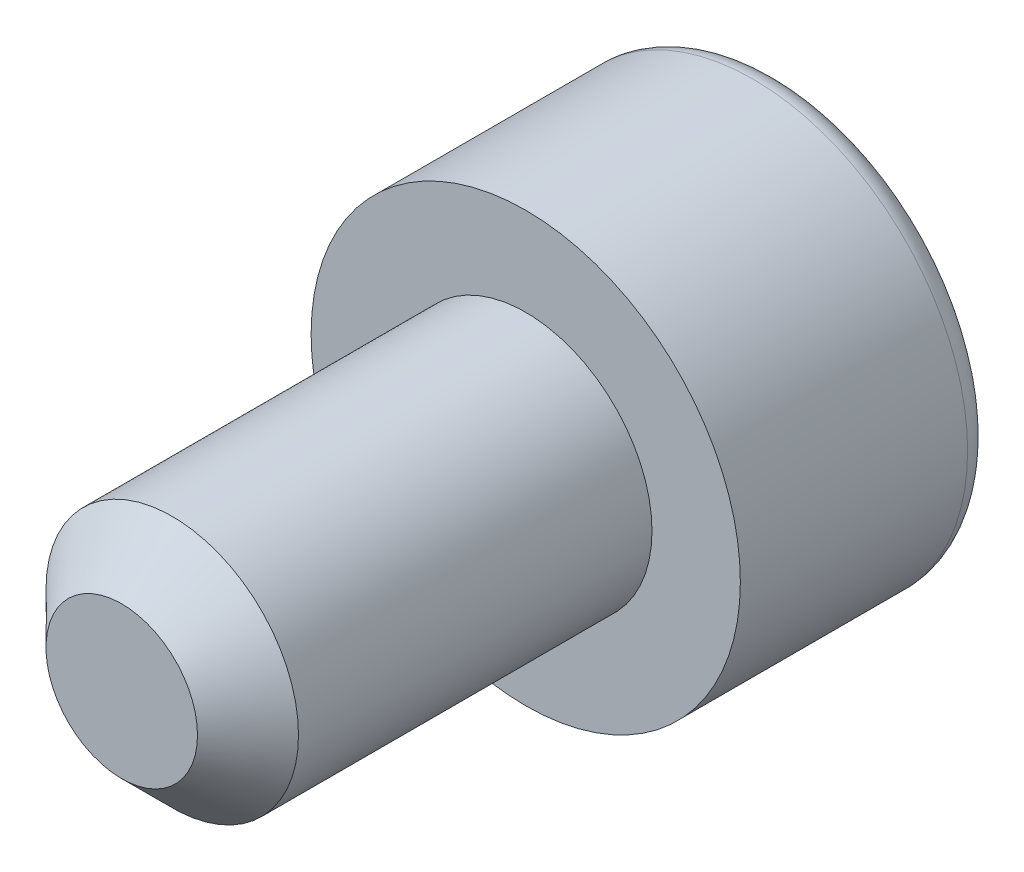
ISO-10303-21;
HEADER;
FILE_DESCRIPTION(('STEP AP214'),'2;1');
FILE_NAME('part.step','',(''),(''),'','','');
FILE_SCHEMA(('AUTOMOTIVE_DESIGN { 1 0 10303 214 1 1 1 1 }'));
ENDSEC;
DATA;
#1=APPLICATION_CONTEXT('core data for automotive mechanical design processes');
#2=APPLICATION_PROTOCOL_DEFINITION('international standard','automotive_design',2000,#1);
#3=PRODUCT_CONTEXT('',#1,'mechanical');
#4=PRODUCT('Part','Part','',(#3));
#5=PRODUCT_RELATED_PRODUCT_CATEGORY('part','',(#4));
#6=PRODUCT_DEFINITION_FORMATION('','',#4);
#7=PRODUCT_DEFINITION_CONTEXT('part definition',#1,'design');
#8=PRODUCT_DEFINITION('design','',#6,#7);
#9=PRODUCT_DEFINITION_SHAPE('','',#8);
#10=(LENGTH_UNIT() NAMED_UNIT(*) SI_UNIT(.MILLI.,.METRE.));
#11=(NAMED_UNIT(*) PLANE_ANGLE_UNIT() SI_UNIT($,.RADIAN.));
#12=(NAMED_UNIT(*) SI_UNIT($,.STERADIAN.) SOLID_ANGLE_UNIT());
#13=UNCERTAINTY_MEASURE_WITH_UNIT(LENGTH_MEASURE(1.E-05),#10,'distance_accuracy_value','');
#14=(GEOMETRIC_REPRESENTATION_CONTEXT(3) GLOBAL_UNCERTAINTY_ASSIGNED_CONTEXT((#13)) GLOBAL_UNIT_ASSIGNED_CONTEXT((#10,
#11,#12)) REPRESENTATION_CONTEXT('',''));
#15=CARTESIAN_POINT('',(0.,0.,0.));
#16=DIRECTION('',(0.,0.,1.));
#17=DIRECTION('',(1.,0.,0.));
#18=AXIS2_PLACEMENT_3D('',#15,#16,#17);
#19=CARTESIAN_POINT('',(0.,0.,-5.));
#20=DIRECTION('',(0.,0.,1.));
#21=DIRECTION('',(1.,0.,0.));
#22=AXIS2_PLACEMENT_3D('',#19,#20,#21);
#23=PLANE('',#22);
#24=CARTESIAN_POINT('',(0.,0.,-5.));
#25=DIRECTION('',(0.,0.,-1.));
#26=DIRECTION('',(-1.,0.,0.));
#27=AXIS2_PLACEMENT_3D('',#24,#25,#26);
#28=CIRCLE('',#27,3.75);
#29=CARTESIAN_POINT('',(-3.75,0.,-5.));
#30=VERTEX_POINT('',#29);
#31=EDGE_CURVE('E460',#30,#30,#28,.T.);
#32=ORIENTED_EDGE('',*,*,#31,.T.);
#33=EDGE_LOOP('',(#32));
#34=FACE_BOUND('',#33,.T.);
#35=DIRECTION('',(-0.86602540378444,0.499999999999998,0.));
#36=VECTOR('',#35,1.);
#37=CARTESIAN_POINT('',(0.,2.3094010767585,-5.));
#38=LINE('',#37,#36);
#39=CARTESIAN_POINT('',(2.,1.15470053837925,-5.));
#40=VERTEX_POINT('',#39);
#41=CARTESIAN_POINT('',(0.,2.3094010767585,-5.));
#42=VERTEX_POINT('',#41);
#43=EDGE_CURVE('E364',#40,#42,#38,.T.);
#44=ORIENTED_EDGE('',*,*,#43,.T.);
#45=DIRECTION('',(-0.866025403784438,-0.500000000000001,0.));
#46=VECTOR('',#45,1.);
#47=CARTESIAN_POINT('',(0.,2.3094010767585,-5.));
#48=LINE('',#47,#46);
#49=CARTESIAN_POINT('',(-2.,1.15470053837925,-5.));
#50=VERTEX_POINT('',#49);
#51=EDGE_CURVE('E404',#42,#50,#48,.T.);
#52=ORIENTED_EDGE('',*,*,#51,.T.);
#53=DIRECTION('',(0.,-1.,0.));
#54=VECTOR('',#53,1.);
#55=CARTESIAN_POINT('',(-2.,-1.15470053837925,-5.));
#56=LINE('',#55,#54);
#57=CARTESIAN_POINT('',(-2.,-1.15470053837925,-5.));
#58=VERTEX_POINT('',#57);
#59=EDGE_CURVE('E412',#50,#58,#56,.T.);
#60=ORIENTED_EDGE('',*,*,#59,.T.);
#61=DIRECTION('',(0.866025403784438,-0.500000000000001,0.));
#62=VECTOR('',#61,1.);
#63=CARTESIAN_POINT('',(0.,-2.3094010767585,-5.));
#64=LINE('',#63,#62);
#65=CARTESIAN_POINT('',(0.,-2.3094010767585,-5.));
#66=VERTEX_POINT('',#65);
#67=EDGE_CURVE('E430',#58,#66,#64,.T.);
#68=ORIENTED_EDGE('',*,*,#67,.T.);
#69=DIRECTION('',(0.86602540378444,0.499999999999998,0.));
#70=VECTOR('',#69,1.);
#71=CARTESIAN_POINT('',(0.,-2.3094010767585,-5.));
#72=LINE('',#71,#70);
#73=CARTESIAN_POINT('',(2.,-1.15470053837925,-5.));
#74=VERTEX_POINT('',#73);
#75=EDGE_CURVE('E433',#66,#74,#72,.T.);
#76=ORIENTED_EDGE('',*,*,#75,.T.);
#77=DIRECTION('',(0.,1.,0.));
#78=VECTOR('',#77,1.);
#79=CARTESIAN_POINT('',(2.,-1.15470053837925,-5.));
#80=LINE('',#79,#78);
#81=EDGE_CURVE('E423',#74,#40,#80,.T.);
#82=ORIENTED_EDGE('',*,*,#81,.T.);
#83=EDGE_LOOP('',(#44,#52,#60,#68,#76,#82));
#84=FACE_BOUND('',#83,.T.);
#85=ADVANCED_FACE('F350',(#34,#84),#23,.F.);
#86=CARTESIAN_POINT('',(0.,0.,-4.5));
#87=DIRECTION('',(0.,0.,-1.));
#88=DIRECTION('',(-1.,0.,0.));
#89=AXIS2_PLACEMENT_3D('',#86,#87,#88);
#90=TOROIDAL_SURFACE('',#89,3.75,0.5);
#91=ORIENTED_EDGE('',*,*,#31,.F.);
#92=EDGE_LOOP('',(#91));
#93=FACE_BOUND('',#92,.T.);
#94=CARTESIAN_POINT('',(0.,0.,-4.5));
#95=DIRECTION('',(0.,0.,-1.));
#96=DIRECTION('',(-1.,0.,0.));
#97=AXIS2_PLACEMENT_3D('',#94,#95,#96);
#98=CIRCLE('',#97,4.25);
#99=CARTESIAN_POINT('',(-4.25,0.,-4.5));
#100=VERTEX_POINT('',#99);
#101=EDGE_CURVE('E457',#100,#100,#98,.T.);
#102=ORIENTED_EDGE('',*,*,#101,.T.);
#103=EDGE_LOOP('',(#102));
#104=FACE_BOUND('',#103,.T.);
#105=ADVANCED_FACE('F479',(#93,#104),#90,.T.);
#106=CARTESIAN_POINT('',(0.,0.,0.));
#107=DIRECTION('',(0.,0.,-1.));
#108=DIRECTION('',(-1.,0.,0.));
#109=AXIS2_PLACEMENT_3D('',#106,#107,#108);
#110=CYLINDRICAL_SURFACE('',#109,4.25);
#111=ORIENTED_EDGE('',*,*,#101,.F.);
#112=EDGE_LOOP('',(#111));
#113=FACE_BOUND('',#112,.T.);
#114=CARTESIAN_POINT('',(0.,0.,0.));
#115=DIRECTION('',(0.,0.,-1.));
#116=DIRECTION('',(-1.,0.,0.));
#117=AXIS2_PLACEMENT_3D('',#114,#115,#116);
#118=CIRCLE('',#117,4.25);
#119=CARTESIAN_POINT('',(-4.25,0.,0.));
#120=VERTEX_POINT('',#119);
#121=EDGE_CURVE('E418',#120,#120,#118,.T.);
#122=ORIENTED_EDGE('',*,*,#121,.T.);
#123=EDGE_LOOP('',(#122));
#124=FACE_BOUND('',#123,.T.);
#125=ADVANCED_FACE('F484',(#113,#124),#110,.T.);
#126=CARTESIAN_POINT('',(0.,0.,0.));
#127=DIRECTION('',(0.,0.,-1.));
#128=DIRECTION('',(-1.,0.,0.));
#129=AXIS2_PLACEMENT_3D('',#126,#127,#128);
#130=PLANE('',#129);
#131=CARTESIAN_POINT('',(0.,0.,0.));
#132=DIRECTION('',(0.,0.,1.));
#133=DIRECTION('',(1.,0.,0.));
#134=AXIS2_PLACEMENT_3D('',#131,#132,#133);
#135=CIRCLE('',#134,2.5);
#136=CARTESIAN_POINT('',(2.5,0.,0.));
#137=VERTEX_POINT('',#136);
#138=EDGE_CURVE('E424',#137,#137,#135,.T.);
#139=ORIENTED_EDGE('',*,*,#138,.F.);
#140=EDGE_LOOP('',(#139));
#141=FACE_BOUND('',#140,.T.);
#142=ORIENTED_EDGE('',*,*,#121,.F.);
#143=EDGE_LOOP('',(#142));
#144=FACE_BOUND('',#143,.T.);
#145=ADVANCED_FACE('F492',(#141,#144),#130,.F.);
#146=CARTESIAN_POINT('',(0.,2.3094010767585,-2.5));
#147=DIRECTION('',(-0.499999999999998,-0.86602540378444,0.));
#148=DIRECTION('',(0.86602540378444,-0.499999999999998,0.));
#149=AXIS2_PLACEMENT_3D('',#146,#147,#148);
#150=PLANE('',#149);
#151=ORIENTED_EDGE('',*,*,#43,.F.);
#152=DIRECTION('',(0.,0.,-1.));
#153=VECTOR('',#152,1.);
#154=CARTESIAN_POINT('',(2.,1.15470053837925,-2.5));
#155=LINE('',#154,#153);
#156=CARTESIAN_POINT('',(2.,1.15470053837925,-2.5));
#157=VERTEX_POINT('',#156);
#158=EDGE_CURVE('E446',#157,#40,#155,.T.);
#159=ORIENTED_EDGE('',*,*,#158,.F.);
#160=DIRECTION('',(-0.86602540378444,0.499999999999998,0.));
#161=VECTOR('',#160,1.);
#162=CARTESIAN_POINT('',(0.,2.3094010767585,-2.5));
#163=LINE('',#162,#161);
#164=CARTESIAN_POINT('',(0.,2.3094010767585,-2.5));
#165=VERTEX_POINT('',#164);
#166=EDGE_CURVE('E417',#157,#165,#163,.T.);
#167=ORIENTED_EDGE('',*,*,#166,.T.);
#168=DIRECTION('',(0.,0.,-1.));
#169=VECTOR('',#168,1.);
#170=CARTESIAN_POINT('',(0.,2.3094010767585,-2.5));
#171=LINE('',#170,#169);
#172=EDGE_CURVE('E406',#165,#42,#171,.T.);
#173=ORIENTED_EDGE('',*,*,#172,.T.);
#174=EDGE_LOOP('',(#151,#159,#167,#173));
#175=FACE_BOUND('',#174,.T.);
#176=ADVANCED_FACE('F415',(#175),#150,.T.);
#177=CARTESIAN_POINT('',(0.,2.3094010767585,-2.5));
#178=DIRECTION('',(0.500000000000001,-0.866025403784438,0.));
#179=DIRECTION('',(0.866025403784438,0.500000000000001,0.));
#180=AXIS2_PLACEMENT_3D('',#177,#178,#179);
#181=PLANE('',#180);
#182=ORIENTED_EDGE('',*,*,#51,.F.);
#183=ORIENTED_EDGE('',*,*,#172,.F.);
#184=DIRECTION('',(-0.866025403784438,-0.500000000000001,0.));
#185=VECTOR('',#184,1.);
#186=CARTESIAN_POINT('',(0.,2.3094010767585,-2.5));
#187=LINE('',#186,#185);
#188=CARTESIAN_POINT('',(-2.,1.15470053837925,-2.5));
#189=VERTEX_POINT('',#188);
#190=EDGE_CURVE('E437',#165,#189,#187,.T.);
#191=ORIENTED_EDGE('',*,*,#190,.T.);
#192=DIRECTION('',(0.,0.,-1.));
#193=VECTOR('',#192,1.);
#194=CARTESIAN_POINT('',(-2.,1.15470053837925,-2.5));
#195=LINE('',#194,#193);
#196=EDGE_CURVE('E408',#189,#50,#195,.T.);
#197=ORIENTED_EDGE('',*,*,#196,.T.);
#198=EDGE_LOOP('',(#182,#183,#191,#197));
#199=FACE_BOUND('',#198,.T.);
#200=ADVANCED_FACE('F405',(#199),#181,.T.);
#201=CARTESIAN_POINT('',(-2.,-1.15470053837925,-2.5));
#202=DIRECTION('',(1.,0.,0.));
#203=DIRECTION('',(0.,0.,-1.));
#204=AXIS2_PLACEMENT_3D('',#201,#202,#203);
#205=PLANE('',#204);
#206=ORIENTED_EDGE('',*,*,#59,.F.);
#207=ORIENTED_EDGE('',*,*,#196,.F.);
#208=DIRECTION('',(0.,-1.,0.));
#209=VECTOR('',#208,1.);
#210=CARTESIAN_POINT('',(-2.,-1.15470053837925,-2.5));
#211=LINE('',#210,#209);
#212=CARTESIAN_POINT('',(-2.,-1.15470053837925,-2.5));
#213=VERTEX_POINT('',#212);
#214=EDGE_CURVE('E439',#189,#213,#211,.T.);
#215=ORIENTED_EDGE('',*,*,#214,.T.);
#216=DIRECTION('',(0.,0.,-1.));
#217=VECTOR('',#216,1.);
#218=CARTESIAN_POINT('',(-2.,-1.15470053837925,-2.5));
#219=LINE('',#218,#217);
#220=EDGE_CURVE('E452',#213,#58,#219,.T.);
#221=ORIENTED_EDGE('',*,*,#220,.T.);
#222=EDGE_LOOP('',(#206,#207,#215,#221));
#223=FACE_BOUND('',#222,.T.);
#224=ADVANCED_FACE('F507',(#223),#205,.T.);
#225=CARTESIAN_POINT('',(0.,-2.3094010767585,-2.5));
#226=DIRECTION('',(0.500000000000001,0.866025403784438,0.));
#227=DIRECTION('',(-0.866025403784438,0.500000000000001,0.));
#228=AXIS2_PLACEMENT_3D('',#225,#226,#227);
#229=PLANE('',#228);
#230=ORIENTED_EDGE('',*,*,#67,.F.);
#231=ORIENTED_EDGE('',*,*,#220,.F.);
#232=DIRECTION('',(0.866025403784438,-0.500000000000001,0.));
#233=VECTOR('',#232,1.);
#234=CARTESIAN_POINT('',(0.,-2.3094010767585,-2.5));
#235=LINE('',#234,#233);
#236=CARTESIAN_POINT('',(0.,-2.3094010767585,-2.5));
#237=VERTEX_POINT('',#236);
#238=EDGE_CURVE('E441',#213,#237,#235,.T.);
#239=ORIENTED_EDGE('',*,*,#238,.T.);
#240=DIRECTION('',(0.,0.,-1.));
#241=VECTOR('',#240,1.);
#242=CARTESIAN_POINT('',(0.,-2.3094010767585,-2.5));
#243=LINE('',#242,#241);
#244=EDGE_CURVE('E450',#237,#66,#243,.T.);
#245=ORIENTED_EDGE('',*,*,#244,.T.);
#246=EDGE_LOOP('',(#230,#231,#239,#245));
#247=FACE_BOUND('',#246,.T.);
#248=ADVANCED_FACE('F510',(#247),#229,.T.);
#249=CARTESIAN_POINT('',(0.,-2.3094010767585,-2.5));
#250=DIRECTION('',(-0.499999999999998,0.86602540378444,0.));
#251=DIRECTION('',(-0.86602540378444,-0.499999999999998,0.));
#252=AXIS2_PLACEMENT_3D('',#249,#250,#251);
#253=PLANE('',#252);
#254=ORIENTED_EDGE('',*,*,#75,.F.);
#255=ORIENTED_EDGE('',*,*,#244,.F.);
#256=DIRECTION('',(0.86602540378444,0.499999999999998,0.));
#257=VECTOR('',#256,1.);
#258=CARTESIAN_POINT('',(0.,-2.3094010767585,-2.5));
#259=LINE('',#258,#257);
#260=CARTESIAN_POINT('',(2.,-1.15470053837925,-2.5));
#261=VERTEX_POINT('',#260);
#262=EDGE_CURVE('E443',#237,#261,#259,.T.);
#263=ORIENTED_EDGE('',*,*,#262,.T.);
#264=DIRECTION('',(0.,0.,-1.));
#265=VECTOR('',#264,1.);
#266=CARTESIAN_POINT('',(2.,-1.15470053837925,-2.5));
#267=LINE('',#266,#265);
#268=EDGE_CURVE('E448',#261,#74,#267,.T.);
#269=ORIENTED_EDGE('',*,*,#268,.T.);
#270=EDGE_LOOP('',(#254,#255,#263,#269));
#271=FACE_BOUND('',#270,.T.);
#272=ADVANCED_FACE('F514',(#271),#253,.T.);
#273=CARTESIAN_POINT('',(2.,-1.15470053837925,-2.5));
#274=DIRECTION('',(-1.,0.,0.));
#275=DIRECTION('',(0.,0.,1.));
#276=AXIS2_PLACEMENT_3D('',#273,#274,#275);
#277=PLANE('',#276);
#278=ORIENTED_EDGE('',*,*,#81,.F.);
#279=ORIENTED_EDGE('',*,*,#268,.F.);
#280=DIRECTION('',(0.,1.,0.));
#281=VECTOR('',#280,1.);
#282=CARTESIAN_POINT('',(2.,-1.15470053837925,-2.5));
#283=LINE('',#282,#281);
#284=EDGE_CURVE('E371',#261,#157,#283,.T.);
#285=ORIENTED_EDGE('',*,*,#284,.T.);
#286=ORIENTED_EDGE('',*,*,#158,.T.);
#287=EDGE_LOOP('',(#278,#279,#285,#286));
#288=FACE_BOUND('',#287,.T.);
#289=ADVANCED_FACE('F518',(#288),#277,.T.);
#290=CARTESIAN_POINT('',(2.,1.15470053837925,-2.5));
#291=DIRECTION('',(0.,0.,1.));
#292=DIRECTION('',(1.,0.,0.));
#293=AXIS2_PLACEMENT_3D('',#290,#291,#292);
#294=PLANE('',#293);
#295=ORIENTED_EDGE('',*,*,#166,.F.);
#296=ORIENTED_EDGE('',*,*,#284,.F.);
#297=ORIENTED_EDGE('',*,*,#262,.F.);
#298=ORIENTED_EDGE('',*,*,#238,.F.);
#299=ORIENTED_EDGE('',*,*,#214,.F.);
#300=ORIENTED_EDGE('',*,*,#190,.F.);
#301=EDGE_LOOP('',(#295,#296,#297,#298,#299,#300));
#302=FACE_BOUND('',#301,.T.);
#303=ADVANCED_FACE('F522',(#302),#294,.F.);
#304=CARTESIAN_POINT('',(0.,0.,8.));
#305=DIRECTION('',(0.,0.,1.));
#306=DIRECTION('',(1.,0.,0.));
#307=AXIS2_PLACEMENT_3D('',#304,#305,#306);
#308=PLANE('',#307);
#309=CARTESIAN_POINT('',(0.,0.,8.));
#310=DIRECTION('',(0.,0.,1.));
#311=DIRECTION('',(1.,0.,0.));
#312=AXIS2_PLACEMENT_3D('',#309,#310,#311);
#313=CIRCLE('',#312,1.49999999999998);
#314=CARTESIAN_POINT('',(1.49999999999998,0.,8.));
#315=VERTEX_POINT('',#314);
#316=EDGE_CURVE('E357',#315,#315,#313,.T.);
#317=ORIENTED_EDGE('',*,*,#316,.T.);
#318=EDGE_LOOP('',(#317));
#319=FACE_BOUND('',#318,.T.);
#320=ADVANCED_FACE('F465',(#319),#308,.T.);
#321=CARTESIAN_POINT('',(0.,0.,0.));
#322=DIRECTION('',(0.,0.,1.));
#323=DIRECTION('',(1.,0.,0.));
#324=AXIS2_PLACEMENT_3D('',#321,#322,#323);
#325=CYLINDRICAL_SURFACE('',#324,2.5);
#326=CARTESIAN_POINT('',(0.,0.,6.99999999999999));
#327=DIRECTION('',(0.,0.,1.));
#328=DIRECTION('',(1.,0.,0.));
#329=AXIS2_PLACEMENT_3D('',#326,#327,#328);
#330=CIRCLE('',#329,2.5);
#331=CARTESIAN_POINT('',(2.5,0.,6.99999999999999));
#332=VERTEX_POINT('',#331);
#333=EDGE_CURVE('E11',#332,#332,#330,.F.);
#334=ORIENTED_EDGE('',*,*,#333,.T.);
#335=EDGE_LOOP('',(#334));
#336=FACE_BOUND('',#335,.T.);
#337=ORIENTED_EDGE('',*,*,#138,.T.);
#338=EDGE_LOOP('',(#337));
#339=FACE_BOUND('',#338,.T.);
#340=ADVANCED_FACE('F469',(#336,#339),#325,.T.);
#341=CARTESIAN_POINT('',(0.,0.,8.));
#342=DIRECTION('',(0.,0.,-1.));
#343=DIRECTION('',(-1.,0.,0.));
#344=AXIS2_PLACEMENT_3D('',#341,#342,#343);
#345=CONICAL_SURFACE('',#344,1.49999999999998,0.785398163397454);
#346=ORIENTED_EDGE('',*,*,#333,.F.);
#347=EDGE_LOOP('',(#346));
#348=FACE_BOUND('',#347,.T.);
#349=ORIENTED_EDGE('',*,*,#316,.F.);
#350=EDGE_LOOP('',(#349));
#351=FACE_BOUND('',#350,.T.);
#352=ADVANCED_FACE('F467',(#348,#351),#345,.T.);
#353=CLOSED_SHELL('',(#85,#105,#125,#145,#176,#200,#224,#248,#272,#289,#303,#320,#340,#352));
#354=MANIFOLD_SOLID_BREP('B2',#353);
#355=ADVANCED_BREP_SHAPE_REPRESENTATION('',(#18,#354),#14);
#356=SHAPE_DEFINITION_REPRESENTATION(#9,#355);
ENDSEC;
END-ISO-10303-21;
